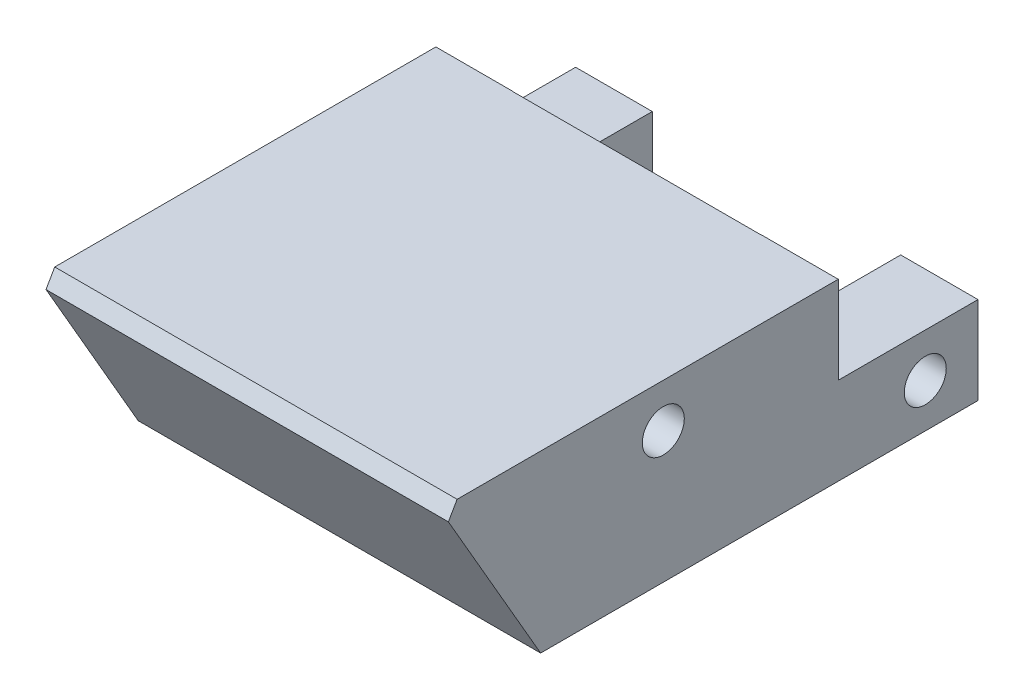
ISO-10303-21;
HEADER;
FILE_DESCRIPTION(('STEP AP214'),'2;1');
FILE_NAME('part.step','',(''),(''),'','','');
FILE_SCHEMA(('AUTOMOTIVE_DESIGN { 1 0 10303 214 1 1 1 1 }'));
ENDSEC;
DATA;
#1=APPLICATION_CONTEXT('core data for automotive mechanical design processes');
#2=APPLICATION_PROTOCOL_DEFINITION('international standard','automotive_design',2000,#1);
#3=PRODUCT_CONTEXT('',#1,'mechanical');
#4=PRODUCT('Part','Part','',(#3));
#5=PRODUCT_RELATED_PRODUCT_CATEGORY('part','',(#4));
#6=PRODUCT_DEFINITION_FORMATION('','',#4);
#7=PRODUCT_DEFINITION_CONTEXT('part definition',#1,'design');
#8=PRODUCT_DEFINITION('design','',#6,#7);
#9=PRODUCT_DEFINITION_SHAPE('','',#8);
#10=(LENGTH_UNIT() NAMED_UNIT(*) SI_UNIT(.MILLI.,.METRE.));
#11=(NAMED_UNIT(*) PLANE_ANGLE_UNIT() SI_UNIT($,.RADIAN.));
#12=(NAMED_UNIT(*) SI_UNIT($,.STERADIAN.) SOLID_ANGLE_UNIT());
#13=UNCERTAINTY_MEASURE_WITH_UNIT(LENGTH_MEASURE(1.E-05),#10,'distance_accuracy_value','');
#14=(GEOMETRIC_REPRESENTATION_CONTEXT(3) GLOBAL_UNCERTAINTY_ASSIGNED_CONTEXT((#13)) GLOBAL_UNIT_ASSIGNED_CONTEXT((#10,
#11,#12)) REPRESENTATION_CONTEXT('',''));
#15=CARTESIAN_POINT('',(0.,0.,0.));
#16=DIRECTION('',(0.,0.,1.));
#17=DIRECTION('',(1.,0.,0.));
#18=AXIS2_PLACEMENT_3D('',#15,#16,#17);
#19=CARTESIAN_POINT('',(0.,10.,-3.50961057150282));
#20=DIRECTION('',(0.,0.,-1.));
#21=DIRECTION('',(-1.,0.,0.));
#22=AXIS2_PLACEMENT_3D('',#19,#20,#21);
#23=PLANE('',#22);
#24=DIRECTION('',(0.,-1.,0.));
#25=VECTOR('',#24,1.);
#26=CARTESIAN_POINT('',(15.7335182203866,10.,-3.50961057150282));
#27=LINE('',#26,#25);
#28=CARTESIAN_POINT('',(15.7335182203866,5.,-3.50961057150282));
#29=VERTEX_POINT('',#28);
#30=CARTESIAN_POINT('',(15.7335182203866,0.,-3.50961057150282));
#31=VERTEX_POINT('',#30);
#32=EDGE_CURVE('E217',#29,#31,#27,.T.);
#33=ORIENTED_EDGE('',*,*,#32,.F.);
#34=DIRECTION('',(-1.,0.,0.));
#35=VECTOR('',#34,1.);
#36=CARTESIAN_POINT('',(-2.84876778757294,5.,-3.50961057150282));
#37=LINE('',#36,#35);
#38=CARTESIAN_POINT('',(20.1512322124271,5.,-3.50961057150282));
#39=VERTEX_POINT('',#38);
#40=EDGE_CURVE('E158',#39,#29,#37,.T.);
#41=ORIENTED_EDGE('',*,*,#40,.F.);
#42=DIRECTION('',(0.,-1.,0.));
#43=VECTOR('',#42,1.);
#44=CARTESIAN_POINT('',(20.1512322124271,10.,-3.50961057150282));
#45=LINE('',#44,#43);
#46=CARTESIAN_POINT('',(20.1512322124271,0.,-3.50961057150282));
#47=VERTEX_POINT('',#46);
#48=EDGE_CURVE('E185',#39,#47,#45,.T.);
#49=ORIENTED_EDGE('',*,*,#48,.T.);
#50=DIRECTION('',(1.,0.,0.));
#51=VECTOR('',#50,1.);
#52=CARTESIAN_POINT('',(0.,0.,-3.50961057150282));
#53=LINE('',#52,#51);
#54=EDGE_CURVE('E173',#31,#47,#53,.T.);
#55=ORIENTED_EDGE('',*,*,#54,.F.);
#56=EDGE_LOOP('',(#33,#41,#49,#55));
#57=FACE_BOUND('',#56,.T.);
#58=ADVANCED_FACE('F39',(#57),#23,.T.);
#59=DIRECTION('',(0.,-1.,0.));
#60=VECTOR('',#59,1.);
#61=CARTESIAN_POINT('',(-2.84876778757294,10.,-3.50961057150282));
#62=LINE('',#61,#60);
#63=CARTESIAN_POINT('',(-2.84876778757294,5.,-3.50961057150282));
#64=VERTEX_POINT('',#63);
#65=CARTESIAN_POINT('',(-2.84876778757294,0.,-3.50961057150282));
#66=VERTEX_POINT('',#65);
#67=EDGE_CURVE('E208',#64,#66,#62,.T.);
#68=ORIENTED_EDGE('',*,*,#67,.F.);
#69=CARTESIAN_POINT('',(1.53351822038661,5.,-3.50961057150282));
#70=VERTEX_POINT('',#69);
#71=EDGE_CURVE('E148',#70,#64,#37,.T.);
#72=ORIENTED_EDGE('',*,*,#71,.F.);
#73=DIRECTION('',(0.,-1.,0.));
#74=VECTOR('',#73,1.);
#75=CARTESIAN_POINT('',(1.53351822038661,10.,-3.50961057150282));
#76=LINE('',#75,#74);
#77=CARTESIAN_POINT('',(1.53351822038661,0.,-3.50961057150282));
#78=VERTEX_POINT('',#77);
#79=EDGE_CURVE('E210',#70,#78,#76,.T.);
#80=ORIENTED_EDGE('',*,*,#79,.T.);
#81=EDGE_CURVE('E189',#66,#78,#53,.T.);
#82=ORIENTED_EDGE('',*,*,#81,.F.);
#83=EDGE_LOOP('',(#68,#72,#80,#82));
#84=FACE_BOUND('',#83,.T.);
#85=ADVANCED_FACE('F262',(#84),#23,.T.);
#86=CARTESIAN_POINT('',(15.7335182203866,10.,0.));
#87=DIRECTION('',(1.,0.,0.));
#88=DIRECTION('',(0.,0.,-1.));
#89=AXIS2_PLACEMENT_3D('',#86,#87,#88);
#90=PLANE('',#89);
#91=CARTESIAN_POINT('',(15.7335182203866,2.5,-0.495365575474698));
#92=DIRECTION('',(1.,0.,0.));
#93=DIRECTION('',(0.,0.,-1.));
#94=AXIS2_PLACEMENT_3D('',#91,#92,#93);
#95=CIRCLE('',#94,1.2);
#96=CARTESIAN_POINT('',(15.7335182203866,2.5,-1.6953655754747));
#97=VERTEX_POINT('',#96);
#98=EDGE_CURVE('E265',#97,#97,#95,.T.);
#99=ORIENTED_EDGE('',*,*,#98,.T.);
#100=EDGE_LOOP('',(#99));
#101=FACE_BOUND('',#100,.T.);
#102=DIRECTION('',(0.,0.,1.));
#103=VECTOR('',#102,1.);
#104=CARTESIAN_POINT('',(15.7335182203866,10.,0.));
#105=LINE('',#104,#103);
#106=CARTESIAN_POINT('',(15.7335182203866,10.,4.47851263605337));
#107=VERTEX_POINT('',#106);
#108=CARTESIAN_POINT('',(15.7335182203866,10.,4.49038942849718));
#109=VERTEX_POINT('',#108);
#110=EDGE_CURVE('E174',#107,#109,#105,.T.);
#111=ORIENTED_EDGE('',*,*,#110,.F.);
#112=DIRECTION('',(0.,-1.,0.));
#113=VECTOR('',#112,1.);
#114=CARTESIAN_POINT('',(15.7335182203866,10.,4.47851263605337));
#115=LINE('',#114,#113);
#116=CARTESIAN_POINT('',(15.7335182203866,5.,4.47851263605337));
#117=VERTEX_POINT('',#116);
#118=EDGE_CURVE('E166',#107,#117,#115,.T.);
#119=ORIENTED_EDGE('',*,*,#118,.T.);
#120=DIRECTION('',(0.,0.,1.));
#121=VECTOR('',#120,1.);
#122=CARTESIAN_POINT('',(15.7335182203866,5.,0.));
#123=LINE('',#122,#121);
#124=EDGE_CURVE('E171',#29,#117,#123,.T.);
#125=ORIENTED_EDGE('',*,*,#124,.F.);
#126=ORIENTED_EDGE('',*,*,#32,.T.);
#127=DIRECTION('',(0.,0.,1.));
#128=VECTOR('',#127,1.);
#129=CARTESIAN_POINT('',(15.7335182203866,0.,0.));
#130=LINE('',#129,#128);
#131=CARTESIAN_POINT('',(15.7335182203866,0.,4.49038942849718));
#132=VERTEX_POINT('',#131);
#133=EDGE_CURVE('E188',#31,#132,#130,.T.);
#134=ORIENTED_EDGE('',*,*,#133,.T.);
#135=DIRECTION('',(0.,-1.,0.));
#136=VECTOR('',#135,1.);
#137=CARTESIAN_POINT('',(15.7335182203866,10.,4.49038942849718));
#138=LINE('',#137,#136);
#139=EDGE_CURVE('E215',#109,#132,#138,.T.);
#140=ORIENTED_EDGE('',*,*,#139,.F.);
#141=EDGE_LOOP('',(#111,#119,#125,#126,#134,#140));
#142=FACE_BOUND('',#141,.T.);
#143=ADVANCED_FACE('F249',(#101,#142),#90,.F.);
#144=CARTESIAN_POINT('',(0.,10.,4.49038942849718));
#145=DIRECTION('',(0.,0.,-1.));
#146=DIRECTION('',(-1.,0.,0.));
#147=AXIS2_PLACEMENT_3D('',#144,#145,#146);
#148=PLANE('',#147);
#149=DIRECTION('',(1.,0.,0.));
#150=VECTOR('',#149,1.);
#151=CARTESIAN_POINT('',(0.,0.,4.49038942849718));
#152=LINE('',#151,#150);
#153=CARTESIAN_POINT('',(1.53351822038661,0.,4.49038942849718));
#154=VERTEX_POINT('',#153);
#155=EDGE_CURVE('E192',#154,#132,#152,.T.);
#156=ORIENTED_EDGE('',*,*,#155,.F.);
#157=DIRECTION('',(0.,-1.,0.));
#158=VECTOR('',#157,1.);
#159=CARTESIAN_POINT('',(1.53351822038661,10.,4.49038942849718));
#160=LINE('',#159,#158);
#161=CARTESIAN_POINT('',(1.53351822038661,10.,4.49038942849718));
#162=VERTEX_POINT('',#161);
#163=EDGE_CURVE('E213',#162,#154,#160,.T.);
#164=ORIENTED_EDGE('',*,*,#163,.F.);
#165=DIRECTION('',(1.,0.,0.));
#166=VECTOR('',#165,1.);
#167=CARTESIAN_POINT('',(0.,10.,4.49038942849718));
#168=LINE('',#167,#166);
#169=EDGE_CURVE('E176',#162,#109,#168,.T.);
#170=ORIENTED_EDGE('',*,*,#169,.T.);
#171=ORIENTED_EDGE('',*,*,#139,.T.);
#172=EDGE_LOOP('',(#156,#164,#170,#171));
#173=FACE_BOUND('',#172,.T.);
#174=ADVANCED_FACE('F255',(#173),#148,.T.);
#175=CARTESIAN_POINT('',(1.53351822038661,10.,0.));
#176=DIRECTION('',(1.,0.,0.));
#177=DIRECTION('',(0.,0.,-1.));
#178=AXIS2_PLACEMENT_3D('',#175,#176,#177);
#179=PLANE('',#178);
#180=CARTESIAN_POINT('',(1.53351822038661,2.5,-0.495365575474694));
#181=DIRECTION('',(1.,0.,0.));
#182=DIRECTION('',(0.,0.,-1.));
#183=AXIS2_PLACEMENT_3D('',#180,#181,#182);
#184=CIRCLE('',#183,1.2);
#185=CARTESIAN_POINT('',(1.53351822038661,2.5,-1.69536557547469));
#186=VERTEX_POINT('',#185);
#187=EDGE_CURVE('E267',#186,#186,#184,.T.);
#188=ORIENTED_EDGE('',*,*,#187,.F.);
#189=EDGE_LOOP('',(#188));
#190=FACE_BOUND('',#189,.T.);
#191=DIRECTION('',(0.,-1.,0.));
#192=VECTOR('',#191,1.);
#193=CARTESIAN_POINT('',(1.53351822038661,10.,4.47851263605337));
#194=LINE('',#193,#192);
#195=CARTESIAN_POINT('',(1.53351822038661,10.,4.47851263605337));
#196=VERTEX_POINT('',#195);
#197=CARTESIAN_POINT('',(1.53351822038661,5.,4.47851263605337));
#198=VERTEX_POINT('',#197);
#199=EDGE_CURVE('E138',#196,#198,#194,.T.);
#200=ORIENTED_EDGE('',*,*,#199,.F.);
#201=DIRECTION('',(0.,0.,1.));
#202=VECTOR('',#201,1.);
#203=CARTESIAN_POINT('',(1.53351822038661,10.,0.));
#204=LINE('',#203,#202);
#205=EDGE_CURVE('E180',#196,#162,#204,.T.);
#206=ORIENTED_EDGE('',*,*,#205,.T.);
#207=ORIENTED_EDGE('',*,*,#163,.T.);
#208=DIRECTION('',(0.,0.,1.));
#209=VECTOR('',#208,1.);
#210=CARTESIAN_POINT('',(1.53351822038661,0.,0.));
#211=LINE('',#210,#209);
#212=EDGE_CURVE('E195',#78,#154,#211,.T.);
#213=ORIENTED_EDGE('',*,*,#212,.F.);
#214=ORIENTED_EDGE('',*,*,#79,.F.);
#215=DIRECTION('',(0.,0.,1.));
#216=VECTOR('',#215,1.);
#217=CARTESIAN_POINT('',(1.53351822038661,5.,0.));
#218=LINE('',#217,#216);
#219=EDGE_CURVE('E169',#70,#198,#218,.T.);
#220=ORIENTED_EDGE('',*,*,#219,.T.);
#221=EDGE_LOOP('',(#200,#206,#207,#213,#214,#220));
#222=FACE_BOUND('',#221,.T.);
#223=ADVANCED_FACE('F258',(#190,#222),#179,.T.);
#224=CARTESIAN_POINT('',(-2.84876778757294,10.,0.));
#225=DIRECTION('',(1.,0.,0.));
#226=DIRECTION('',(0.,0.,-1.));
#227=AXIS2_PLACEMENT_3D('',#224,#225,#226);
#228=PLANE('',#227);
#229=CARTESIAN_POINT('',(-2.84876778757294,7.5,14.4785126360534));
#230=DIRECTION('',(-1.,0.,0.));
#231=DIRECTION('',(0.,0.,1.));
#232=AXIS2_PLACEMENT_3D('',#229,#230,#231);
#233=CIRCLE('',#232,1.2);
#234=CARTESIAN_POINT('',(-2.84876778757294,7.5,15.6785126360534));
#235=VERTEX_POINT('',#234);
#236=EDGE_CURVE('E228',#235,#235,#233,.T.);
#237=ORIENTED_EDGE('',*,*,#236,.F.);
#238=EDGE_LOOP('',(#237));
#239=FACE_BOUND('',#238,.T.);
#240=CARTESIAN_POINT('',(-2.84876778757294,2.5,-0.495365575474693));
#241=DIRECTION('',(1.,0.,0.));
#242=DIRECTION('',(0.,0.,-1.));
#243=AXIS2_PLACEMENT_3D('',#240,#241,#242);
#244=CIRCLE('',#243,1.2);
#245=CARTESIAN_POINT('',(-2.84876778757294,2.5,-1.69536557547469));
#246=VERTEX_POINT('',#245);
#247=EDGE_CURVE('E272',#246,#246,#244,.T.);
#248=ORIENTED_EDGE('',*,*,#247,.T.);
#249=EDGE_LOOP('',(#248));
#250=FACE_BOUND('',#249,.T.);
#251=DIRECTION('',(0.,0.866025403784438,0.500000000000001));
#252=VECTOR('',#251,1.);
#253=CARTESIAN_POINT('',(-2.84876778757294,0.,21.4903894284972));
#254=LINE('',#253,#252);
#255=CARTESIAN_POINT('',(-2.84876778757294,9.13397459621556,26.7638921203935));
#256=VERTEX_POINT('',#255);
#257=CARTESIAN_POINT('',(-2.84876778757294,0.,21.4903894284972));
#258=VERTEX_POINT('',#257);
#259=EDGE_CURVE('E211',#256,#258,#254,.F.);
#260=ORIENTED_EDGE('',*,*,#259,.F.);
#261=DIRECTION('',(0.,-0.866025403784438,0.500000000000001));
#262=VECTOR('',#261,1.);
#263=CARTESIAN_POINT('',(-2.84876778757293,10.,26.2638921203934));
#264=LINE('',#263,#262);
#265=CARTESIAN_POINT('',(-2.84876778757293,10.,26.2638921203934));
#266=VERTEX_POINT('',#265);
#267=EDGE_CURVE('E11',#256,#266,#264,.F.);
#268=ORIENTED_EDGE('',*,*,#267,.T.);
#269=DIRECTION('',(0.,0.,1.));
#270=VECTOR('',#269,1.);
#271=CARTESIAN_POINT('',(-2.84876778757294,10.,0.));
#272=LINE('',#271,#270);
#273=CARTESIAN_POINT('',(-2.84876778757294,10.,4.47851263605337));
#274=VERTEX_POINT('',#273);
#275=EDGE_CURVE('E156',#274,#266,#272,.T.);
#276=ORIENTED_EDGE('',*,*,#275,.F.);
#277=DIRECTION('',(0.,1.,0.));
#278=VECTOR('',#277,1.);
#279=CARTESIAN_POINT('',(-2.84876778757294,5.,4.47851263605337));
#280=LINE('',#279,#278);
#281=CARTESIAN_POINT('',(-2.84876778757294,5.,4.47851263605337));
#282=VERTEX_POINT('',#281);
#283=EDGE_CURVE('E135',#282,#274,#280,.T.);
#284=ORIENTED_EDGE('',*,*,#283,.F.);
#285=DIRECTION('',(0.,0.,1.));
#286=VECTOR('',#285,1.);
#287=CARTESIAN_POINT('',(-2.84876778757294,5.,-3.50961057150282));
#288=LINE('',#287,#286);
#289=EDGE_CURVE('E145',#64,#282,#288,.T.);
#290=ORIENTED_EDGE('',*,*,#289,.F.);
#291=ORIENTED_EDGE('',*,*,#67,.T.);
#292=DIRECTION('',(0.,0.,1.));
#293=VECTOR('',#292,1.);
#294=CARTESIAN_POINT('',(-2.84876778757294,0.,0.));
#295=LINE('',#294,#293);
#296=EDGE_CURVE('E198',#66,#258,#295,.T.);
#297=ORIENTED_EDGE('',*,*,#296,.T.);
#298=EDGE_LOOP('',(#260,#268,#276,#284,#290,#291,#297));
#299=FACE_BOUND('',#298,.T.);
#300=ADVANCED_FACE('F154',(#239,#250,#299),#228,.F.);
#301=CARTESIAN_POINT('',(0.,0.,21.4903894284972));
#302=DIRECTION('',(0.,-0.500000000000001,0.866025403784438));
#303=DIRECTION('',(0.,-0.866025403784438,-0.500000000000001));
#304=AXIS2_PLACEMENT_3D('',#301,#302,#303);
#305=PLANE('',#304);
#306=DIRECTION('',(0.,0.866025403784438,0.500000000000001));
#307=VECTOR('',#306,1.);
#308=CARTESIAN_POINT('',(20.1512322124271,0.,21.4903894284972));
#309=LINE('',#308,#307);
#310=CARTESIAN_POINT('',(20.1512322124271,9.13397459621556,26.7638921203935));
#311=VERTEX_POINT('',#310);
#312=CARTESIAN_POINT('',(20.1512322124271,0.,21.4903894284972));
#313=VERTEX_POINT('',#312);
#314=EDGE_CURVE('E207',#311,#313,#309,.F.);
#315=ORIENTED_EDGE('',*,*,#314,.F.);
#316=DIRECTION('',(1.,0.,0.));
#317=VECTOR('',#316,1.);
#318=CARTESIAN_POINT('',(-2.84876778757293,9.13397459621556,26.7638921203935));
#319=LINE('',#318,#317);
#320=EDGE_CURVE('E47',#311,#256,#319,.F.);
#321=ORIENTED_EDGE('',*,*,#320,.T.);
#322=ORIENTED_EDGE('',*,*,#259,.T.);
#323=DIRECTION('',(1.,0.,0.));
#324=VECTOR('',#323,1.);
#325=CARTESIAN_POINT('',(0.,0.,21.4903894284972));
#326=LINE('',#325,#324);
#327=EDGE_CURVE('E201',#258,#313,#326,.T.);
#328=ORIENTED_EDGE('',*,*,#327,.T.);
#329=EDGE_LOOP('',(#315,#321,#322,#328));
#330=FACE_BOUND('',#329,.T.);
#331=ADVANCED_FACE('F286',(#330),#305,.T.);
#332=CARTESIAN_POINT('',(20.1512322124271,10.,0.));
#333=DIRECTION('',(1.,0.,0.));
#334=DIRECTION('',(0.,0.,-1.));
#335=AXIS2_PLACEMENT_3D('',#332,#333,#334);
#336=PLANE('',#335);
#337=CARTESIAN_POINT('',(20.1512322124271,7.5,14.4785126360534));
#338=DIRECTION('',(1.,0.,0.));
#339=DIRECTION('',(0.,0.,-1.));
#340=AXIS2_PLACEMENT_3D('',#337,#338,#339);
#341=CIRCLE('',#340,1.2);
#342=CARTESIAN_POINT('',(20.1512322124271,7.5,13.2785126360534));
#343=VERTEX_POINT('',#342);
#344=EDGE_CURVE('E224',#343,#343,#341,.T.);
#345=ORIENTED_EDGE('',*,*,#344,.F.);
#346=EDGE_LOOP('',(#345));
#347=FACE_BOUND('',#346,.T.);
#348=CARTESIAN_POINT('',(20.1512322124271,2.5,-0.495365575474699));
#349=DIRECTION('',(1.,0.,0.));
#350=DIRECTION('',(0.,0.,-1.));
#351=AXIS2_PLACEMENT_3D('',#348,#349,#350);
#352=CIRCLE('',#351,1.2);
#353=CARTESIAN_POINT('',(20.1512322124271,2.5,-1.6953655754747));
#354=VERTEX_POINT('',#353);
#355=EDGE_CURVE('E227',#354,#354,#352,.T.);
#356=ORIENTED_EDGE('',*,*,#355,.F.);
#357=EDGE_LOOP('',(#356));
#358=FACE_BOUND('',#357,.T.);
#359=DIRECTION('',(0.,0.,1.));
#360=VECTOR('',#359,1.);
#361=CARTESIAN_POINT('',(20.1512322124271,10.,0.));
#362=LINE('',#361,#360);
#363=CARTESIAN_POINT('',(20.1512322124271,10.,4.47851263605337));
#364=VERTEX_POINT('',#363);
#365=CARTESIAN_POINT('',(20.1512322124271,10.,26.2638921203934));
#366=VERTEX_POINT('',#365);
#367=EDGE_CURVE('E183',#364,#366,#362,.T.);
#368=ORIENTED_EDGE('',*,*,#367,.T.);
#369=DIRECTION('',(0.,0.866025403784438,-0.500000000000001));
#370=VECTOR('',#369,1.);
#371=CARTESIAN_POINT('',(20.1512322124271,21.3725988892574,19.6979190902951));
#372=LINE('',#371,#370);
#373=EDGE_CURVE('E61',#366,#311,#372,.F.);
#374=ORIENTED_EDGE('',*,*,#373,.T.);
#375=ORIENTED_EDGE('',*,*,#314,.T.);
#376=DIRECTION('',(0.,0.,1.));
#377=VECTOR('',#376,1.);
#378=CARTESIAN_POINT('',(20.1512322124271,0.,0.));
#379=LINE('',#378,#377);
#380=EDGE_CURVE('E177',#47,#313,#379,.T.);
#381=ORIENTED_EDGE('',*,*,#380,.F.);
#382=ORIENTED_EDGE('',*,*,#48,.F.);
#383=DIRECTION('',(0.,0.,-1.));
#384=VECTOR('',#383,1.);
#385=CARTESIAN_POINT('',(20.1512322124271,5.,-3.50961057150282));
#386=LINE('',#385,#384);
#387=CARTESIAN_POINT('',(20.1512322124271,5.,4.47851263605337));
#388=VERTEX_POINT('',#387);
#389=EDGE_CURVE('E141',#388,#39,#386,.T.);
#390=ORIENTED_EDGE('',*,*,#389,.F.);
#391=DIRECTION('',(0.,1.,0.));
#392=VECTOR('',#391,1.);
#393=CARTESIAN_POINT('',(20.1512322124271,5.,4.47851263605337));
#394=LINE('',#393,#392);
#395=EDGE_CURVE('E157',#388,#364,#394,.T.);
#396=ORIENTED_EDGE('',*,*,#395,.T.);
#397=EDGE_LOOP('',(#368,#374,#375,#381,#382,#390,#396));
#398=FACE_BOUND('',#397,.T.);
#399=ADVANCED_FACE('F238',(#347,#358,#398),#336,.T.);
#400=CARTESIAN_POINT('',(0.,10.,0.));
#401=DIRECTION('',(0.,1.,0.));
#402=DIRECTION('',(0.,0.,1.));
#403=AXIS2_PLACEMENT_3D('',#400,#401,#402);
#404=PLANE('',#403);
#405=ORIENTED_EDGE('',*,*,#275,.T.);
#406=DIRECTION('',(1.,0.,0.));
#407=VECTOR('',#406,1.);
#408=CARTESIAN_POINT('',(20.1512322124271,10.,26.2638921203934));
#409=LINE('',#408,#407);
#410=EDGE_CURVE('E221',#266,#366,#409,.T.);
#411=ORIENTED_EDGE('',*,*,#410,.T.);
#412=ORIENTED_EDGE('',*,*,#367,.F.);
#413=DIRECTION('',(1.,0.,0.));
#414=VECTOR('',#413,1.);
#415=CARTESIAN_POINT('',(0.,10.,4.47851263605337));
#416=LINE('',#415,#414);
#417=EDGE_CURVE('E219',#107,#364,#416,.T.);
#418=ORIENTED_EDGE('',*,*,#417,.F.);
#419=ORIENTED_EDGE('',*,*,#110,.T.);
#420=ORIENTED_EDGE('',*,*,#169,.F.);
#421=ORIENTED_EDGE('',*,*,#205,.F.);
#422=DIRECTION('',(1.,0.,0.));
#423=VECTOR('',#422,1.);
#424=CARTESIAN_POINT('',(-2.84876778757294,10.,4.47851263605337));
#425=LINE('',#424,#423);
#426=EDGE_CURVE('E151',#274,#196,#425,.T.);
#427=ORIENTED_EDGE('',*,*,#426,.F.);
#428=EDGE_LOOP('',(#405,#411,#412,#418,#419,#420,#421,#427));
#429=FACE_BOUND('',#428,.T.);
#430=ADVANCED_FACE('F234',(#429),#404,.T.);
#431=CARTESIAN_POINT('',(0.,0.,0.));
#432=DIRECTION('',(0.,1.,0.));
#433=DIRECTION('',(0.,0.,1.));
#434=AXIS2_PLACEMENT_3D('',#431,#432,#433);
#435=PLANE('',#434);
#436=ORIENTED_EDGE('',*,*,#54,.T.);
#437=ORIENTED_EDGE('',*,*,#380,.T.);
#438=ORIENTED_EDGE('',*,*,#327,.F.);
#439=ORIENTED_EDGE('',*,*,#296,.F.);
#440=ORIENTED_EDGE('',*,*,#81,.T.);
#441=ORIENTED_EDGE('',*,*,#212,.T.);
#442=ORIENTED_EDGE('',*,*,#155,.T.);
#443=ORIENTED_EDGE('',*,*,#133,.F.);
#444=EDGE_LOOP('',(#436,#437,#438,#439,#440,#441,#442,#443));
#445=FACE_BOUND('',#444,.T.);
#446=ADVANCED_FACE('F328',(#445),#435,.F.);
#447=CARTESIAN_POINT('',(-2.84876778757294,5.,4.47851263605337));
#448=DIRECTION('',(0.,0.,1.));
#449=DIRECTION('',(1.,0.,0.));
#450=AXIS2_PLACEMENT_3D('',#447,#448,#449);
#451=PLANE('',#450);
#452=ORIENTED_EDGE('',*,*,#417,.T.);
#453=ORIENTED_EDGE('',*,*,#395,.F.);
#454=DIRECTION('',(1.,0.,0.));
#455=VECTOR('',#454,1.);
#456=CARTESIAN_POINT('',(-2.84876778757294,5.,4.47851263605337));
#457=LINE('',#456,#455);
#458=EDGE_CURVE('E142',#117,#388,#457,.T.);
#459=ORIENTED_EDGE('',*,*,#458,.F.);
#460=ORIENTED_EDGE('',*,*,#118,.F.);
#461=EDGE_LOOP('',(#452,#453,#459,#460));
#462=FACE_BOUND('',#461,.T.);
#463=ADVANCED_FACE('F244',(#462),#451,.F.);
#464=CARTESIAN_POINT('',(0.,5.,0.));
#465=DIRECTION('',(0.,1.,0.));
#466=DIRECTION('',(0.,0.,1.));
#467=AXIS2_PLACEMENT_3D('',#464,#465,#466);
#468=PLANE('',#467);
#469=ORIENTED_EDGE('',*,*,#124,.T.);
#470=ORIENTED_EDGE('',*,*,#458,.T.);
#471=ORIENTED_EDGE('',*,*,#389,.T.);
#472=ORIENTED_EDGE('',*,*,#40,.T.);
#473=EDGE_LOOP('',(#469,#470,#471,#472));
#474=FACE_BOUND('',#473,.T.);
#475=ADVANCED_FACE('F332',(#474),#468,.T.);
#476=ORIENTED_EDGE('',*,*,#199,.T.);
#477=EDGE_CURVE('E131',#282,#198,#457,.T.);
#478=ORIENTED_EDGE('',*,*,#477,.F.);
#479=ORIENTED_EDGE('',*,*,#283,.T.);
#480=ORIENTED_EDGE('',*,*,#426,.T.);
#481=EDGE_LOOP('',(#476,#478,#479,#480));
#482=FACE_BOUND('',#481,.T.);
#483=ADVANCED_FACE('F133',(#482),#451,.F.);
#484=ORIENTED_EDGE('',*,*,#71,.T.);
#485=ORIENTED_EDGE('',*,*,#289,.T.);
#486=ORIENTED_EDGE('',*,*,#477,.T.);
#487=ORIENTED_EDGE('',*,*,#219,.F.);
#488=EDGE_LOOP('',(#484,#485,#486,#487));
#489=FACE_BOUND('',#488,.T.);
#490=ADVANCED_FACE('F146',(#489),#468,.T.);
#491=CARTESIAN_POINT('',(-9.84876778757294,2.5,-0.495365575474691));
#492=DIRECTION('',(1.,0.,0.));
#493=DIRECTION('',(0.,0.,-1.));
#494=AXIS2_PLACEMENT_3D('',#491,#492,#493);
#495=CYLINDRICAL_SURFACE('',#494,1.2);
#496=ORIENTED_EDGE('',*,*,#355,.T.);
#497=EDGE_LOOP('',(#496));
#498=FACE_BOUND('',#497,.T.);
#499=ORIENTED_EDGE('',*,*,#98,.F.);
#500=EDGE_LOOP('',(#499));
#501=FACE_BOUND('',#500,.T.);
#502=ADVANCED_FACE('F292',(#498,#501),#495,.F.);
#503=ORIENTED_EDGE('',*,*,#187,.T.);
#504=EDGE_LOOP('',(#503));
#505=FACE_BOUND('',#504,.T.);
#506=ORIENTED_EDGE('',*,*,#247,.F.);
#507=EDGE_LOOP('',(#506));
#508=FACE_BOUND('',#507,.T.);
#509=ADVANCED_FACE('F290',(#505,#508),#495,.F.);
#510=CARTESIAN_POINT('',(27.1512322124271,7.5,14.4785126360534));
#511=DIRECTION('',(-1.,0.,0.));
#512=DIRECTION('',(0.,0.,1.));
#513=AXIS2_PLACEMENT_3D('',#510,#511,#512);
#514=CYLINDRICAL_SURFACE('',#513,1.2);
#515=ORIENTED_EDGE('',*,*,#344,.T.);
#516=EDGE_LOOP('',(#515));
#517=FACE_BOUND('',#516,.T.);
#518=ORIENTED_EDGE('',*,*,#236,.T.);
#519=EDGE_LOOP('',(#518));
#520=FACE_BOUND('',#519,.T.);
#521=ADVANCED_FACE('F282',(#517,#520),#514,.F.);
#522=CARTESIAN_POINT('',(0.,10.,26.2638921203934));
#523=DIRECTION('',(0.,-0.500000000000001,-0.866025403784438));
#524=DIRECTION('',(1.,0.,0.));
#525=AXIS2_PLACEMENT_3D('',#522,#523,#524);
#526=PLANE('',#525);
#527=ORIENTED_EDGE('',*,*,#267,.F.);
#528=ORIENTED_EDGE('',*,*,#320,.F.);
#529=ORIENTED_EDGE('',*,*,#373,.F.);
#530=ORIENTED_EDGE('',*,*,#410,.F.);
#531=EDGE_LOOP('',(#527,#528,#529,#530));
#532=FACE_BOUND('',#531,.T.);
#533=ADVANCED_FACE('F41',(#532),#526,.F.);
#534=CLOSED_SHELL('',(#58,#85,#143,#174,#223,#300,#331,#399,#430,#446,#463,#475,#483,#490,#502,
#509,#521,#533));
#535=MANIFOLD_SOLID_BREP('B2',#534);
#536=ADVANCED_BREP_SHAPE_REPRESENTATION('',(#18,#535),#14);
#537=SHAPE_DEFINITION_REPRESENTATION(#9,#536);
ENDSEC;
END-ISO-10303-21;
